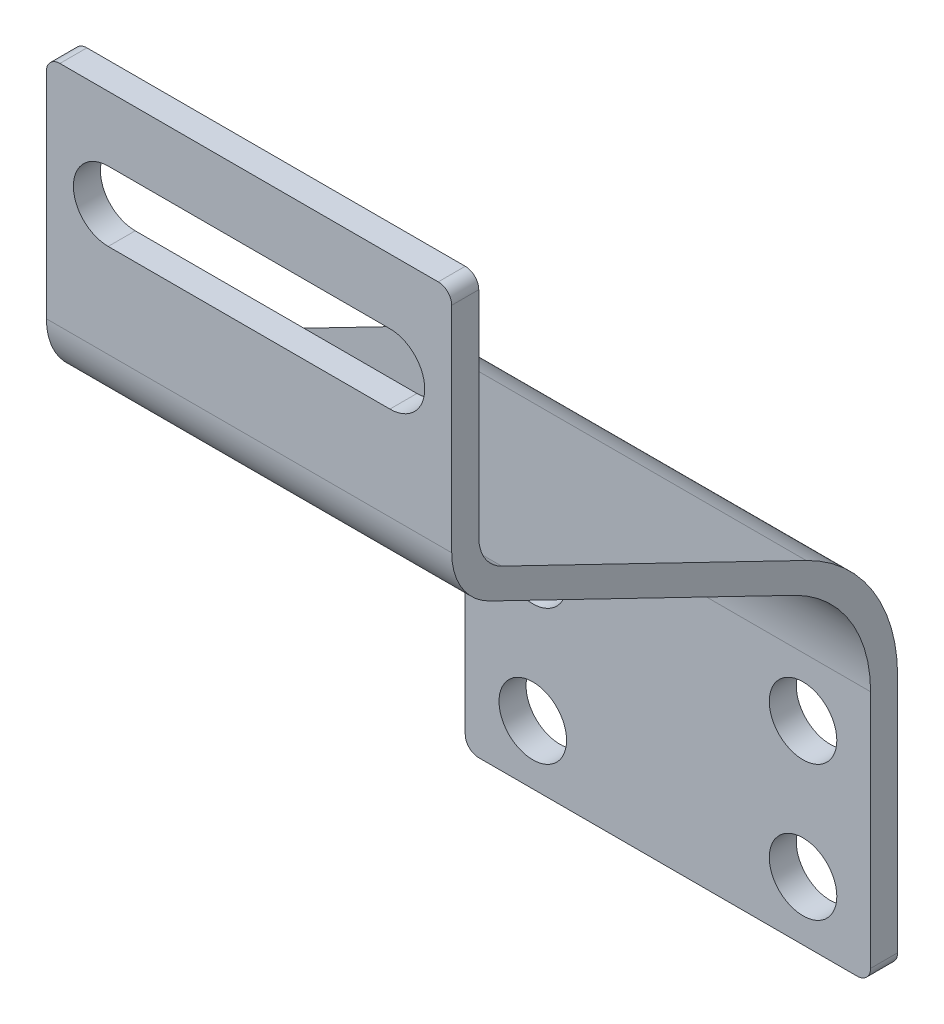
ISO-10303-21;
HEADER;
FILE_DESCRIPTION(('STEP AP214'),'2;1');
FILE_NAME('part.step','',(''),(''),'','','');
FILE_SCHEMA(('AUTOMOTIVE_DESIGN { 1 0 10303 214 1 1 1 1 }'));
ENDSEC;
DATA;
#1=APPLICATION_CONTEXT('core data for automotive mechanical design processes');
#2=APPLICATION_PROTOCOL_DEFINITION('international standard','automotive_design',2000,#1);
#3=PRODUCT_CONTEXT('',#1,'mechanical');
#4=PRODUCT('Part','Part','',(#3));
#5=PRODUCT_RELATED_PRODUCT_CATEGORY('part','',(#4));
#6=PRODUCT_DEFINITION_FORMATION('','',#4);
#7=PRODUCT_DEFINITION_CONTEXT('part definition',#1,'design');
#8=PRODUCT_DEFINITION('design','',#6,#7);
#9=PRODUCT_DEFINITION_SHAPE('','',#8);
#10=(LENGTH_UNIT() NAMED_UNIT(*) SI_UNIT(.MILLI.,.METRE.));
#11=(NAMED_UNIT(*) PLANE_ANGLE_UNIT() SI_UNIT($,.RADIAN.));
#12=(NAMED_UNIT(*) SI_UNIT($,.STERADIAN.) SOLID_ANGLE_UNIT());
#13=UNCERTAINTY_MEASURE_WITH_UNIT(LENGTH_MEASURE(1.E-05),#10,'distance_accuracy_value','');
#14=(GEOMETRIC_REPRESENTATION_CONTEXT(3) GLOBAL_UNCERTAINTY_ASSIGNED_CONTEXT((#13)) GLOBAL_UNIT_ASSIGNED_CONTEXT((#10,
#11,#12)) REPRESENTATION_CONTEXT('',''));
#15=CARTESIAN_POINT('',(0.,0.,0.));
#16=DIRECTION('',(0.,0.,1.));
#17=DIRECTION('',(1.,0.,0.));
#18=AXIS2_PLACEMENT_3D('',#15,#16,#17);
#19=CARTESIAN_POINT('',(30.,40.,-2.));
#20=DIRECTION('',(0.,1.,0.));
#21=DIRECTION('',(0.,0.,-1.));
#22=AXIS2_PLACEMENT_3D('',#19,#20,#21);
#23=PLANE('',#22);
#24=DIRECTION('',(-1.,0.,0.));
#25=VECTOR('',#24,1.);
#26=CARTESIAN_POINT('',(30.,40.,2.));
#27=LINE('',#26,#25);
#28=CARTESIAN_POINT('',(28.,40.,2.));
#29=VERTEX_POINT('',#28);
#30=CARTESIAN_POINT('',(-28.,40.,2.));
#31=VERTEX_POINT('',#30);
#32=EDGE_CURVE('E246',#29,#31,#27,.T.);
#33=ORIENTED_EDGE('',*,*,#32,.F.);
#34=DIRECTION('',(0.,0.,1.));
#35=VECTOR('',#34,1.);
#36=CARTESIAN_POINT('',(28.,40.,2.));
#37=LINE('',#36,#35);
#38=CARTESIAN_POINT('',(28.,40.,-2.));
#39=VERTEX_POINT('',#38);
#40=EDGE_CURVE('E356',#39,#29,#37,.T.);
#41=ORIENTED_EDGE('',*,*,#40,.F.);
#42=DIRECTION('',(-1.,0.,0.));
#43=VECTOR('',#42,1.);
#44=CARTESIAN_POINT('',(30.,40.,-2.));
#45=LINE('',#44,#43);
#46=CARTESIAN_POINT('',(-28.,40.,-2.));
#47=VERTEX_POINT('',#46);
#48=EDGE_CURVE('E273',#39,#47,#45,.T.);
#49=ORIENTED_EDGE('',*,*,#48,.T.);
#50=DIRECTION('',(0.,0.,1.));
#51=VECTOR('',#50,1.);
#52=CARTESIAN_POINT('',(-28.,40.,-2.));
#53=LINE('',#52,#51);
#54=EDGE_CURVE('E358',#31,#47,#53,.F.);
#55=ORIENTED_EDGE('',*,*,#54,.F.);
#56=EDGE_LOOP('',(#33,#41,#49,#55));
#57=FACE_BOUND('',#56,.T.);
#58=ADVANCED_FACE('F37',(#57),#23,.T.);
#59=CARTESIAN_POINT('',(30.,40.,-2.));
#60=DIRECTION('',(0.,0.,1.));
#61=DIRECTION('',(0.,1.,0.));
#62=AXIS2_PLACEMENT_3D('',#59,#60,#61);
#63=PLANE('',#62);
#64=DIRECTION('',(1.,0.,0.));
#65=VECTOR('',#64,1.);
#66=CARTESIAN_POINT('',(-20.85,20.119247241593,-2.));
#67=LINE('',#66,#65);
#68=CARTESIAN_POINT('',(-20.85,20.119247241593,-2.));
#69=VERTEX_POINT('',#68);
#70=CARTESIAN_POINT('',(20.85,20.119247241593,-2.));
#71=VERTEX_POINT('',#70);
#72=EDGE_CURVE('E177',#69,#71,#67,.T.);
#73=ORIENTED_EDGE('',*,*,#72,.T.);
#74=CARTESIAN_POINT('',(20.85,25.269247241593,-2.));
#75=DIRECTION('',(0.,0.,1.));
#76=DIRECTION('',(1.,0.,0.));
#77=AXIS2_PLACEMENT_3D('',#74,#75,#76);
#78=CIRCLE('',#77,5.15000000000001);
#79=CARTESIAN_POINT('',(20.85,30.419247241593,-2.));
#80=VERTEX_POINT('',#79);
#81=EDGE_CURVE('E187',#71,#80,#78,.T.);
#82=ORIENTED_EDGE('',*,*,#81,.T.);
#83=DIRECTION('',(-1.,0.,0.));
#84=VECTOR('',#83,1.);
#85=CARTESIAN_POINT('',(-20.85,30.419247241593,-2.));
#86=LINE('',#85,#84);
#87=CARTESIAN_POINT('',(-20.85,30.419247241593,-2.));
#88=VERTEX_POINT('',#87);
#89=EDGE_CURVE('E192',#80,#88,#86,.T.);
#90=ORIENTED_EDGE('',*,*,#89,.T.);
#91=CARTESIAN_POINT('',(-20.85,25.269247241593,-2.));
#92=DIRECTION('',(0.,0.,1.));
#93=DIRECTION('',(1.,0.,0.));
#94=AXIS2_PLACEMENT_3D('',#91,#92,#93);
#95=CIRCLE('',#94,5.15000000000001);
#96=EDGE_CURVE('E197',#88,#69,#95,.T.);
#97=ORIENTED_EDGE('',*,*,#96,.T.);
#98=EDGE_LOOP('',(#73,#82,#90,#97));
#99=FACE_BOUND('',#98,.T.);
#100=ORIENTED_EDGE('',*,*,#48,.F.);
#101=CARTESIAN_POINT('',(28.,38.,-2.));
#102=DIRECTION('',(0.,0.,-1.));
#103=DIRECTION('',(0.,1.,0.));
#104=AXIS2_PLACEMENT_3D('',#101,#102,#103);
#105=CIRCLE('',#104,2.);
#106=CARTESIAN_POINT('',(30.,38.,-2.));
#107=VERTEX_POINT('',#106);
#108=EDGE_CURVE('E45',#107,#39,#105,.F.);
#109=ORIENTED_EDGE('',*,*,#108,.F.);
#110=DIRECTION('',(0.,-1.,0.));
#111=VECTOR('',#110,1.);
#112=CARTESIAN_POINT('',(30.,40.,-2.));
#113=LINE('',#112,#111);
#114=CARTESIAN_POINT('',(30.,6.27043571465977,-2.));
#115=VERTEX_POINT('',#114);
#116=EDGE_CURVE('E243',#107,#115,#113,.T.);
#117=ORIENTED_EDGE('',*,*,#116,.T.);
#118=DIRECTION('',(-1.,0.,0.));
#119=VECTOR('',#118,1.);
#120=CARTESIAN_POINT('',(30.,6.27043571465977,-2.));
#121=LINE('',#120,#119);
#122=CARTESIAN_POINT('',(-30.,6.27043571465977,-2.));
#123=VERTEX_POINT('',#122);
#124=EDGE_CURVE('E276',#115,#123,#121,.T.);
#125=ORIENTED_EDGE('',*,*,#124,.T.);
#126=DIRECTION('',(0.,-1.,0.));
#127=VECTOR('',#126,1.);
#128=CARTESIAN_POINT('',(-30.,40.,-2.));
#129=LINE('',#128,#127);
#130=CARTESIAN_POINT('',(-30.,38.,-2.));
#131=VERTEX_POINT('',#130);
#132=EDGE_CURVE('E222',#131,#123,#129,.T.);
#133=ORIENTED_EDGE('',*,*,#132,.F.);
#134=CARTESIAN_POINT('',(-28.,38.,-2.));
#135=DIRECTION('',(0.,0.,-1.));
#136=DIRECTION('',(0.,1.,0.));
#137=AXIS2_PLACEMENT_3D('',#134,#135,#136);
#138=CIRCLE('',#137,2.);
#139=EDGE_CURVE('E11',#47,#131,#138,.F.);
#140=ORIENTED_EDGE('',*,*,#139,.F.);
#141=EDGE_LOOP('',(#100,#109,#117,#125,#133,#140));
#142=FACE_BOUND('',#141,.T.);
#143=ADVANCED_FACE('F195',(#99,#142),#63,.F.);
#144=CARTESIAN_POINT('',(30.,6.27043571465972,-8.));
#145=DIRECTION('',(-1.,0.,0.));
#146=DIRECTION('',(0.,0.,-1.));
#147=AXIS2_PLACEMENT_3D('',#144,#145,#146);
#148=CYLINDRICAL_SURFACE('',#147,6.);
#149=CARTESIAN_POINT('',(-30.,6.27043571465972,-8.));
#150=DIRECTION('',(1.,0.,0.));
#151=DIRECTION('',(0.,0.,-1.));
#152=AXIS2_PLACEMENT_3D('',#149,#150,#151);
#153=CIRCLE('',#152,6.);
#154=CARTESIAN_POINT('',(-30.,0.869480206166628,-5.38663443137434));
#155=VERTEX_POINT('',#154);
#156=EDGE_CURVE('E268',#123,#155,#153,.T.);
#157=ORIENTED_EDGE('',*,*,#156,.F.);
#158=ORIENTED_EDGE('',*,*,#124,.F.);
#159=CARTESIAN_POINT('',(30.,6.27043571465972,-8.));
#160=DIRECTION('',(1.,0.,0.));
#161=DIRECTION('',(0.,0.,-1.));
#162=AXIS2_PLACEMENT_3D('',#159,#160,#161);
#163=CIRCLE('',#162,6.);
#164=CARTESIAN_POINT('',(30.,0.869480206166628,-5.38663443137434));
#165=VERTEX_POINT('',#164);
#166=EDGE_CURVE('E240',#115,#165,#163,.T.);
#167=ORIENTED_EDGE('',*,*,#166,.T.);
#168=DIRECTION('',(-1.,0.,0.));
#169=VECTOR('',#168,1.);
#170=CARTESIAN_POINT('',(30.,0.869480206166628,-5.38663443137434));
#171=LINE('',#170,#169);
#172=EDGE_CURVE('E279',#165,#155,#171,.T.);
#173=ORIENTED_EDGE('',*,*,#172,.T.);
#174=EDGE_LOOP('',(#157,#158,#167,#173));
#175=FACE_BOUND('',#174,.T.);
#176=ADVANCED_FACE('F372',(#175),#148,.F.);
#177=CARTESIAN_POINT('',(30.,0.869480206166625,-5.38663443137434));
#178=DIRECTION('',(0.,-0.900159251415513,0.435560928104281));
#179=DIRECTION('',(0.,0.435560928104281,0.900159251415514));
#180=AXIS2_PLACEMENT_3D('',#177,#178,#179);
#181=PLANE('',#180);
#182=DIRECTION('',(0.,-0.435560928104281,-0.900159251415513));
#183=VECTOR('',#182,1.);
#184=CARTESIAN_POINT('',(-30.,0.869480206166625,-5.38663443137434));
#185=LINE('',#184,#183);
#186=CARTESIAN_POINT('',(-30.,-20.9370493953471,-50.4534622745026));
#187=VERTEX_POINT('',#186);
#188=EDGE_CURVE('E265',#155,#187,#185,.T.);
#189=ORIENTED_EDGE('',*,*,#188,.F.);
#190=ORIENTED_EDGE('',*,*,#172,.F.);
#191=DIRECTION('',(0.,-0.435560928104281,-0.900159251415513));
#192=VECTOR('',#191,1.);
#193=CARTESIAN_POINT('',(30.,0.869480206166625,-5.38663443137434));
#194=LINE('',#193,#192);
#195=CARTESIAN_POINT('',(30.,-20.9370493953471,-50.4534622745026));
#196=VERTEX_POINT('',#195);
#197=EDGE_CURVE('E237',#165,#196,#194,.T.);
#198=ORIENTED_EDGE('',*,*,#197,.T.);
#199=DIRECTION('',(-1.,0.,0.));
#200=VECTOR('',#199,1.);
#201=CARTESIAN_POINT('',(30.,-20.9370493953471,-50.4534622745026));
#202=LINE('',#201,#200);
#203=EDGE_CURVE('E282',#196,#187,#202,.T.);
#204=ORIENTED_EDGE('',*,*,#203,.T.);
#205=EDGE_LOOP('',(#189,#190,#198,#204));
#206=FACE_BOUND('',#205,.T.);
#207=ADVANCED_FACE('F429',(#206),#181,.F.);
#208=CARTESIAN_POINT('',(30.,-42.5408714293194,-40.));
#209=DIRECTION('',(-1.,0.,0.));
#210=DIRECTION('',(0.,0.,-1.));
#211=AXIS2_PLACEMENT_3D('',#208,#209,#210);
#212=CYLINDRICAL_SURFACE('',#211,24.);
#213=CARTESIAN_POINT('',(-30.,-42.5408714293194,-40.));
#214=DIRECTION('',(-1.,0.,0.));
#215=DIRECTION('',(0.,0.,1.));
#216=AXIS2_PLACEMENT_3D('',#213,#214,#215);
#217=CIRCLE('',#216,24.);
#218=CARTESIAN_POINT('',(-30.,-42.5408714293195,-64.));
#219=VERTEX_POINT('',#218);
#220=EDGE_CURVE('E262',#187,#219,#217,.T.);
#221=ORIENTED_EDGE('',*,*,#220,.F.);
#222=ORIENTED_EDGE('',*,*,#203,.F.);
#223=CARTESIAN_POINT('',(30.,-42.5408714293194,-40.));
#224=DIRECTION('',(-1.,0.,0.));
#225=DIRECTION('',(0.,0.,1.));
#226=AXIS2_PLACEMENT_3D('',#223,#224,#225);
#227=CIRCLE('',#226,24.);
#228=CARTESIAN_POINT('',(30.,-42.5408714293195,-64.));
#229=VERTEX_POINT('',#228);
#230=EDGE_CURVE('E234',#196,#229,#227,.T.);
#231=ORIENTED_EDGE('',*,*,#230,.T.);
#232=DIRECTION('',(-1.,0.,0.));
#233=VECTOR('',#232,1.);
#234=CARTESIAN_POINT('',(30.,-42.5408714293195,-64.));
#235=LINE('',#234,#233);
#236=EDGE_CURVE('E285',#229,#219,#235,.T.);
#237=ORIENTED_EDGE('',*,*,#236,.T.);
#238=EDGE_LOOP('',(#221,#222,#231,#237));
#239=FACE_BOUND('',#238,.T.);
#240=ADVANCED_FACE('F427',(#239),#212,.T.);
#241=CARTESIAN_POINT('',(30.,-42.5408714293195,-64.));
#242=DIRECTION('',(0.,0.,1.));
#243=DIRECTION('',(-1.,0.,0.));
#244=AXIS2_PLACEMENT_3D('',#241,#242,#243);
#245=PLANE('',#244);
#246=CARTESIAN_POINT('',(-20.,-71.2704357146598,-64.));
#247=DIRECTION('',(0.,0.,1.));
#248=DIRECTION('',(1.,0.,0.));
#249=AXIS2_PLACEMENT_3D('',#246,#247,#248);
#250=CIRCLE('',#249,5.);
#251=CARTESIAN_POINT('',(-15.,-71.2704357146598,-64.));
#252=VERTEX_POINT('',#251);
#253=EDGE_CURVE('E204',#252,#252,#250,.T.);
#254=ORIENTED_EDGE('',*,*,#253,.T.);
#255=EDGE_LOOP('',(#254));
#256=FACE_BOUND('',#255,.T.);
#257=CARTESIAN_POINT('',(20.,-71.2704357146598,-64.));
#258=DIRECTION('',(0.,0.,1.));
#259=DIRECTION('',(1.,0.,0.));
#260=AXIS2_PLACEMENT_3D('',#257,#258,#259);
#261=CIRCLE('',#260,5.);
#262=CARTESIAN_POINT('',(25.,-71.2704357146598,-64.));
#263=VERTEX_POINT('',#262);
#264=EDGE_CURVE('E211',#263,#263,#261,.T.);
#265=ORIENTED_EDGE('',*,*,#264,.T.);
#266=EDGE_LOOP('',(#265));
#267=FACE_BOUND('',#266,.T.);
#268=CARTESIAN_POINT('',(20.,-51.2704357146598,-64.));
#269=DIRECTION('',(0.,0.,1.));
#270=DIRECTION('',(1.,0.,0.));
#271=AXIS2_PLACEMENT_3D('',#268,#269,#270);
#272=CIRCLE('',#271,5.);
#273=CARTESIAN_POINT('',(25.,-51.2704357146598,-64.));
#274=VERTEX_POINT('',#273);
#275=EDGE_CURVE('E207',#274,#274,#272,.T.);
#276=ORIENTED_EDGE('',*,*,#275,.T.);
#277=EDGE_LOOP('',(#276));
#278=FACE_BOUND('',#277,.T.);
#279=CARTESIAN_POINT('',(-20.,-51.2704357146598,-64.));
#280=DIRECTION('',(0.,0.,1.));
#281=DIRECTION('',(1.,0.,0.));
#282=AXIS2_PLACEMENT_3D('',#279,#280,#281);
#283=CIRCLE('',#282,5.);
#284=CARTESIAN_POINT('',(-15.,-51.2704357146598,-64.));
#285=VERTEX_POINT('',#284);
#286=EDGE_CURVE('E210',#285,#285,#283,.T.);
#287=ORIENTED_EDGE('',*,*,#286,.T.);
#288=EDGE_LOOP('',(#287));
#289=FACE_BOUND('',#288,.T.);
#290=DIRECTION('',(0.,-1.,0.));
#291=VECTOR('',#290,1.);
#292=CARTESIAN_POINT('',(-30.,-42.5408714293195,-64.));
#293=LINE('',#292,#291);
#294=CARTESIAN_POINT('',(-30.,-78.,-64.));
#295=VERTEX_POINT('',#294);
#296=EDGE_CURVE('E259',#219,#295,#293,.T.);
#297=ORIENTED_EDGE('',*,*,#296,.F.);
#298=ORIENTED_EDGE('',*,*,#236,.F.);
#299=DIRECTION('',(0.,-1.,0.));
#300=VECTOR('',#299,1.);
#301=CARTESIAN_POINT('',(30.,-42.5408714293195,-64.));
#302=LINE('',#301,#300);
#303=CARTESIAN_POINT('',(30.,-78.,-64.));
#304=VERTEX_POINT('',#303);
#305=EDGE_CURVE('E231',#229,#304,#302,.T.);
#306=ORIENTED_EDGE('',*,*,#305,.T.);
#307=CARTESIAN_POINT('',(28.,-78.,-64.));
#308=DIRECTION('',(0.,0.,-1.));
#309=DIRECTION('',(-1.,0.,0.));
#310=AXIS2_PLACEMENT_3D('',#307,#308,#309);
#311=CIRCLE('',#310,2.);
#312=CARTESIAN_POINT('',(28.,-80.,-64.));
#313=VERTEX_POINT('',#312);
#314=EDGE_CURVE('E331',#313,#304,#311,.F.);
#315=ORIENTED_EDGE('',*,*,#314,.F.);
#316=DIRECTION('',(-1.,0.,0.));
#317=VECTOR('',#316,1.);
#318=CARTESIAN_POINT('',(30.,-80.,-64.));
#319=LINE('',#318,#317);
#320=CARTESIAN_POINT('',(-28.,-80.,-64.));
#321=VERTEX_POINT('',#320);
#322=EDGE_CURVE('E288',#313,#321,#319,.T.);
#323=ORIENTED_EDGE('',*,*,#322,.T.);
#324=CARTESIAN_POINT('',(-28.,-78.,-64.));
#325=DIRECTION('',(0.,0.,-1.));
#326=DIRECTION('',(-1.,0.,0.));
#327=AXIS2_PLACEMENT_3D('',#324,#325,#326);
#328=CIRCLE('',#327,2.);
#329=EDGE_CURVE('E334',#295,#321,#328,.F.);
#330=ORIENTED_EDGE('',*,*,#329,.F.);
#331=EDGE_LOOP('',(#297,#298,#306,#315,#323,#330));
#332=FACE_BOUND('',#331,.T.);
#333=ADVANCED_FACE('F416',(#256,#267,#278,#289,#332),#245,.F.);
#334=CARTESIAN_POINT('',(30.,-80.,-60.));
#335=DIRECTION('',(0.,-1.,0.));
#336=DIRECTION('',(0.,0.,1.));
#337=AXIS2_PLACEMENT_3D('',#334,#335,#336);
#338=PLANE('',#337);
#339=ORIENTED_EDGE('',*,*,#322,.F.);
#340=DIRECTION('',(0.,0.,-1.));
#341=VECTOR('',#340,1.);
#342=CARTESIAN_POINT('',(28.,-80.,-64.));
#343=LINE('',#342,#341);
#344=CARTESIAN_POINT('',(28.,-80.,-60.));
#345=VERTEX_POINT('',#344);
#346=EDGE_CURVE('E337',#345,#313,#343,.T.);
#347=ORIENTED_EDGE('',*,*,#346,.F.);
#348=DIRECTION('',(-1.,0.,0.));
#349=VECTOR('',#348,1.);
#350=CARTESIAN_POINT('',(30.,-80.,-60.));
#351=LINE('',#350,#349);
#352=CARTESIAN_POINT('',(-28.,-80.,-60.));
#353=VERTEX_POINT('',#352);
#354=EDGE_CURVE('E291',#345,#353,#351,.T.);
#355=ORIENTED_EDGE('',*,*,#354,.T.);
#356=DIRECTION('',(0.,0.,-1.));
#357=VECTOR('',#356,1.);
#358=CARTESIAN_POINT('',(-28.,-80.,-60.));
#359=LINE('',#358,#357);
#360=EDGE_CURVE('E339',#321,#353,#359,.F.);
#361=ORIENTED_EDGE('',*,*,#360,.F.);
#362=EDGE_LOOP('',(#339,#347,#355,#361));
#363=FACE_BOUND('',#362,.T.);
#364=ADVANCED_FACE('F412',(#363),#338,.T.);
#365=CARTESIAN_POINT('',(30.,-42.5408714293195,-60.));
#366=DIRECTION('',(0.,0.,1.));
#367=DIRECTION('',(0.,1.,0.));
#368=AXIS2_PLACEMENT_3D('',#365,#366,#367);
#369=PLANE('',#368);
#370=CARTESIAN_POINT('',(-20.,-71.2704357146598,-60.));
#371=DIRECTION('',(0.,0.,-1.));
#372=DIRECTION('',(0.,1.,0.));
#373=AXIS2_PLACEMENT_3D('',#370,#371,#372);
#374=CIRCLE('',#373,5.);
#375=CARTESIAN_POINT('',(-20.,-66.2704357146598,-60.));
#376=VERTEX_POINT('',#375);
#377=EDGE_CURVE('E250',#376,#376,#374,.T.);
#378=ORIENTED_EDGE('',*,*,#377,.T.);
#379=EDGE_LOOP('',(#378));
#380=FACE_BOUND('',#379,.T.);
#381=CARTESIAN_POINT('',(20.,-71.2704357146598,-60.));
#382=DIRECTION('',(0.,0.,-1.));
#383=DIRECTION('',(0.,1.,0.));
#384=AXIS2_PLACEMENT_3D('',#381,#382,#383);
#385=CIRCLE('',#384,5.);
#386=CARTESIAN_POINT('',(20.,-66.2704357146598,-60.));
#387=VERTEX_POINT('',#386);
#388=EDGE_CURVE('E313',#387,#387,#385,.T.);
#389=ORIENTED_EDGE('',*,*,#388,.T.);
#390=EDGE_LOOP('',(#389));
#391=FACE_BOUND('',#390,.T.);
#392=CARTESIAN_POINT('',(20.,-51.2704357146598,-60.));
#393=DIRECTION('',(0.,0.,-1.));
#394=DIRECTION('',(0.,1.,0.));
#395=AXIS2_PLACEMENT_3D('',#392,#393,#394);
#396=CIRCLE('',#395,5.);
#397=CARTESIAN_POINT('',(20.,-46.2704357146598,-60.));
#398=VERTEX_POINT('',#397);
#399=EDGE_CURVE('E310',#398,#398,#396,.T.);
#400=ORIENTED_EDGE('',*,*,#399,.T.);
#401=EDGE_LOOP('',(#400));
#402=FACE_BOUND('',#401,.T.);
#403=CARTESIAN_POINT('',(-20.,-51.2704357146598,-60.));
#404=DIRECTION('',(0.,0.,-1.));
#405=DIRECTION('',(0.,1.,0.));
#406=AXIS2_PLACEMENT_3D('',#403,#404,#405);
#407=CIRCLE('',#406,5.);
#408=CARTESIAN_POINT('',(-20.,-46.2704357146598,-60.));
#409=VERTEX_POINT('',#408);
#410=EDGE_CURVE('E218',#409,#409,#407,.T.);
#411=ORIENTED_EDGE('',*,*,#410,.T.);
#412=EDGE_LOOP('',(#411));
#413=FACE_BOUND('',#412,.T.);
#414=ORIENTED_EDGE('',*,*,#354,.F.);
#415=CARTESIAN_POINT('',(28.,-78.,-60.));
#416=DIRECTION('',(0.,0.,-1.));
#417=DIRECTION('',(0.,1.,0.));
#418=AXIS2_PLACEMENT_3D('',#415,#416,#417);
#419=CIRCLE('',#418,2.);
#420=CARTESIAN_POINT('',(30.,-78.,-60.));
#421=VERTEX_POINT('',#420);
#422=EDGE_CURVE('E342',#421,#345,#419,.T.);
#423=ORIENTED_EDGE('',*,*,#422,.F.);
#424=DIRECTION('',(0.,-1.,0.));
#425=VECTOR('',#424,1.);
#426=CARTESIAN_POINT('',(30.,-42.5408714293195,-60.));
#427=LINE('',#426,#425);
#428=CARTESIAN_POINT('',(30.,-42.5408714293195,-60.));
#429=VERTEX_POINT('',#428);
#430=EDGE_CURVE('E228',#429,#421,#427,.T.);
#431=ORIENTED_EDGE('',*,*,#430,.F.);
#432=DIRECTION('',(-1.,0.,0.));
#433=VECTOR('',#432,1.);
#434=CARTESIAN_POINT('',(30.,-42.5408714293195,-60.));
#435=LINE('',#434,#433);
#436=CARTESIAN_POINT('',(-30.,-42.5408714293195,-60.));
#437=VERTEX_POINT('',#436);
#438=EDGE_CURVE('E294',#429,#437,#435,.T.);
#439=ORIENTED_EDGE('',*,*,#438,.T.);
#440=DIRECTION('',(0.,-1.,0.));
#441=VECTOR('',#440,1.);
#442=CARTESIAN_POINT('',(-30.,-42.5408714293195,-60.));
#443=LINE('',#442,#441);
#444=CARTESIAN_POINT('',(-30.,-78.,-60.));
#445=VERTEX_POINT('',#444);
#446=EDGE_CURVE('E256',#437,#445,#443,.T.);
#447=ORIENTED_EDGE('',*,*,#446,.T.);
#448=CARTESIAN_POINT('',(-28.,-78.,-60.));
#449=DIRECTION('',(0.,0.,-1.));
#450=DIRECTION('',(0.,1.,0.));
#451=AXIS2_PLACEMENT_3D('',#448,#449,#450);
#452=CIRCLE('',#451,2.);
#453=EDGE_CURVE('E344',#353,#445,#452,.T.);
#454=ORIENTED_EDGE('',*,*,#453,.F.);
#455=EDGE_LOOP('',(#414,#423,#431,#439,#447,#454));
#456=FACE_BOUND('',#455,.T.);
#457=ADVANCED_FACE('F410',(#380,#391,#402,#413,#456),#369,.T.);
#458=CARTESIAN_POINT('',(30.,-42.5408714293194,-40.));
#459=DIRECTION('',(-1.,0.,0.));
#460=DIRECTION('',(0.,0.,-1.));
#461=AXIS2_PLACEMENT_3D('',#458,#459,#460);
#462=CYLINDRICAL_SURFACE('',#461,20.);
#463=CARTESIAN_POINT('',(-30.,-42.5408714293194,-40.));
#464=DIRECTION('',(-1.,0.,0.));
#465=DIRECTION('',(0.,0.,1.));
#466=AXIS2_PLACEMENT_3D('',#463,#464,#465);
#467=CIRCLE('',#466,20.);
#468=CARTESIAN_POINT('',(-30.,-24.5376864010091,-48.7112185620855));
#469=VERTEX_POINT('',#468);
#470=EDGE_CURVE('E254',#469,#437,#467,.T.);
#471=ORIENTED_EDGE('',*,*,#470,.T.);
#472=ORIENTED_EDGE('',*,*,#438,.F.);
#473=CARTESIAN_POINT('',(30.,-42.5408714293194,-40.));
#474=DIRECTION('',(-1.,0.,0.));
#475=DIRECTION('',(0.,0.,1.));
#476=AXIS2_PLACEMENT_3D('',#473,#474,#475);
#477=CIRCLE('',#476,20.);
#478=CARTESIAN_POINT('',(30.,-24.5376864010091,-48.7112185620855));
#479=VERTEX_POINT('',#478);
#480=EDGE_CURVE('E226',#479,#429,#477,.T.);
#481=ORIENTED_EDGE('',*,*,#480,.F.);
#482=DIRECTION('',(-1.,0.,0.));
#483=VECTOR('',#482,1.);
#484=CARTESIAN_POINT('',(30.,-24.5376864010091,-48.7112185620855));
#485=LINE('',#484,#483);
#486=EDGE_CURVE('E297',#479,#469,#485,.T.);
#487=ORIENTED_EDGE('',*,*,#486,.T.);
#488=EDGE_LOOP('',(#471,#472,#481,#487));
#489=FACE_BOUND('',#488,.T.);
#490=ADVANCED_FACE('F422',(#489),#462,.F.);
#491=CARTESIAN_POINT('',(30.,-2.73115679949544,-3.64439071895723));
#492=DIRECTION('',(0.,-0.900159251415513,0.435560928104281));
#493=DIRECTION('',(0.,0.435560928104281,0.900159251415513));
#494=AXIS2_PLACEMENT_3D('',#491,#492,#493);
#495=PLANE('',#494);
#496=DIRECTION('',(0.,-0.435560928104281,-0.900159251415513));
#497=VECTOR('',#496,1.);
#498=CARTESIAN_POINT('',(-30.,-2.73115679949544,-3.64439071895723));
#499=LINE('',#498,#497);
#500=CARTESIAN_POINT('',(-30.,-2.73115679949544,-3.64439071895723));
#501=VERTEX_POINT('',#500);
#502=EDGE_CURVE('E252',#501,#469,#499,.T.);
#503=ORIENTED_EDGE('',*,*,#502,.T.);
#504=ORIENTED_EDGE('',*,*,#486,.F.);
#505=DIRECTION('',(0.,-0.435560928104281,-0.900159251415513));
#506=VECTOR('',#505,1.);
#507=CARTESIAN_POINT('',(30.,-2.73115679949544,-3.64439071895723));
#508=LINE('',#507,#506);
#509=CARTESIAN_POINT('',(30.,-2.73115679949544,-3.64439071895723));
#510=VERTEX_POINT('',#509);
#511=EDGE_CURVE('E224',#510,#479,#508,.T.);
#512=ORIENTED_EDGE('',*,*,#511,.F.);
#513=DIRECTION('',(-1.,0.,0.));
#514=VECTOR('',#513,1.);
#515=CARTESIAN_POINT('',(30.,-2.73115679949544,-3.64439071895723));
#516=LINE('',#515,#514);
#517=EDGE_CURVE('E300',#510,#501,#516,.T.);
#518=ORIENTED_EDGE('',*,*,#517,.T.);
#519=EDGE_LOOP('',(#503,#504,#512,#518));
#520=FACE_BOUND('',#519,.T.);
#521=ADVANCED_FACE('F449',(#520),#495,.T.);
#522=CARTESIAN_POINT('',(30.,6.27043571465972,-8.));
#523=DIRECTION('',(-1.,0.,0.));
#524=DIRECTION('',(0.,0.,-1.));
#525=AXIS2_PLACEMENT_3D('',#522,#523,#524);
#526=CYLINDRICAL_SURFACE('',#525,10.);
#527=CARTESIAN_POINT('',(-30.,6.27043571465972,-8.));
#528=DIRECTION('',(1.,0.,0.));
#529=DIRECTION('',(0.,0.,-1.));
#530=AXIS2_PLACEMENT_3D('',#527,#528,#529);
#531=CIRCLE('',#530,10.);
#532=CARTESIAN_POINT('',(-30.,6.27043571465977,2.));
#533=VERTEX_POINT('',#532);
#534=EDGE_CURVE('E249',#533,#501,#531,.T.);
#535=ORIENTED_EDGE('',*,*,#534,.T.);
#536=ORIENTED_EDGE('',*,*,#517,.F.);
#537=CARTESIAN_POINT('',(30.,6.27043571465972,-8.));
#538=DIRECTION('',(1.,0.,0.));
#539=DIRECTION('',(0.,0.,-1.));
#540=AXIS2_PLACEMENT_3D('',#537,#538,#539);
#541=CIRCLE('',#540,10.);
#542=CARTESIAN_POINT('',(30.,6.27043571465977,2.));
#543=VERTEX_POINT('',#542);
#544=EDGE_CURVE('E221',#543,#510,#541,.T.);
#545=ORIENTED_EDGE('',*,*,#544,.F.);
#546=DIRECTION('',(-1.,0.,0.));
#547=VECTOR('',#546,1.);
#548=CARTESIAN_POINT('',(30.,6.27043571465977,2.));
#549=LINE('',#548,#547);
#550=EDGE_CURVE('E303',#543,#533,#549,.T.);
#551=ORIENTED_EDGE('',*,*,#550,.T.);
#552=EDGE_LOOP('',(#535,#536,#545,#551));
#553=FACE_BOUND('',#552,.T.);
#554=ADVANCED_FACE('F451',(#553),#526,.T.);
#555=CARTESIAN_POINT('',(30.,40.,2.));
#556=DIRECTION('',(0.,0.,1.));
#557=DIRECTION('',(0.,1.,0.));
#558=AXIS2_PLACEMENT_3D('',#555,#556,#557);
#559=PLANE('',#558);
#560=CARTESIAN_POINT('',(-20.85,25.269247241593,2.));
#561=DIRECTION('',(0.,0.,-1.));
#562=DIRECTION('',(0.,1.,0.));
#563=AXIS2_PLACEMENT_3D('',#560,#561,#562);
#564=CIRCLE('',#563,5.15000000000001);
#565=CARTESIAN_POINT('',(-20.85,20.119247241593,2.));
#566=VERTEX_POINT('',#565);
#567=CARTESIAN_POINT('',(-20.85,30.419247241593,2.));
#568=VERTEX_POINT('',#567);
#569=EDGE_CURVE('E324',#566,#568,#564,.T.);
#570=ORIENTED_EDGE('',*,*,#569,.T.);
#571=DIRECTION('',(1.,0.,0.));
#572=VECTOR('',#571,1.);
#573=CARTESIAN_POINT('',(30.,30.419247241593,2.));
#574=LINE('',#573,#572);
#575=CARTESIAN_POINT('',(20.85,30.419247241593,2.));
#576=VERTEX_POINT('',#575);
#577=EDGE_CURVE('E321',#568,#576,#574,.T.);
#578=ORIENTED_EDGE('',*,*,#577,.T.);
#579=CARTESIAN_POINT('',(20.85,25.269247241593,2.));
#580=DIRECTION('',(0.,0.,-1.));
#581=DIRECTION('',(0.,1.,0.));
#582=AXIS2_PLACEMENT_3D('',#579,#580,#581);
#583=CIRCLE('',#582,5.15000000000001);
#584=CARTESIAN_POINT('',(20.85,20.119247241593,2.));
#585=VERTEX_POINT('',#584);
#586=EDGE_CURVE('E319',#576,#585,#583,.T.);
#587=ORIENTED_EDGE('',*,*,#586,.T.);
#588=DIRECTION('',(-1.,0.,0.));
#589=VECTOR('',#588,1.);
#590=CARTESIAN_POINT('',(30.,20.119247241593,2.));
#591=LINE('',#590,#589);
#592=EDGE_CURVE('E179',#585,#566,#591,.T.);
#593=ORIENTED_EDGE('',*,*,#592,.T.);
#594=EDGE_LOOP('',(#570,#578,#587,#593));
#595=FACE_BOUND('',#594,.T.);
#596=DIRECTION('',(0.,-1.,0.));
#597=VECTOR('',#596,1.);
#598=CARTESIAN_POINT('',(-30.,40.,2.));
#599=LINE('',#598,#597);
#600=CARTESIAN_POINT('',(-30.,38.,2.));
#601=VERTEX_POINT('',#600);
#602=EDGE_CURVE('E247',#601,#533,#599,.T.);
#603=ORIENTED_EDGE('',*,*,#602,.T.);
#604=ORIENTED_EDGE('',*,*,#550,.F.);
#605=DIRECTION('',(0.,-1.,0.));
#606=VECTOR('',#605,1.);
#607=CARTESIAN_POINT('',(30.,40.,2.));
#608=LINE('',#607,#606);
#609=CARTESIAN_POINT('',(30.,38.,2.));
#610=VERTEX_POINT('',#609);
#611=EDGE_CURVE('E219',#610,#543,#608,.T.);
#612=ORIENTED_EDGE('',*,*,#611,.F.);
#613=CARTESIAN_POINT('',(28.,38.,2.));
#614=DIRECTION('',(0.,0.,-1.));
#615=DIRECTION('',(0.,1.,0.));
#616=AXIS2_PLACEMENT_3D('',#613,#614,#615);
#617=CIRCLE('',#616,2.);
#618=EDGE_CURVE('E351',#29,#610,#617,.T.);
#619=ORIENTED_EDGE('',*,*,#618,.F.);
#620=ORIENTED_EDGE('',*,*,#32,.T.);
#621=CARTESIAN_POINT('',(-28.,38.,2.));
#622=DIRECTION('',(0.,0.,-1.));
#623=DIRECTION('',(0.,1.,0.));
#624=AXIS2_PLACEMENT_3D('',#621,#622,#623);
#625=CIRCLE('',#624,2.);
#626=EDGE_CURVE('E354',#601,#31,#625,.T.);
#627=ORIENTED_EDGE('',*,*,#626,.F.);
#628=EDGE_LOOP('',(#603,#604,#612,#619,#620,#627));
#629=FACE_BOUND('',#628,.T.);
#630=ADVANCED_FACE('F379',(#595,#629),#559,.T.);
#631=CARTESIAN_POINT('',(30.,6.27043571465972,-8.));
#632=DIRECTION('',(-1.,0.,0.));
#633=DIRECTION('',(0.,0.,-1.));
#634=AXIS2_PLACEMENT_3D('',#631,#632,#633);
#635=PLANE('',#634);
#636=ORIENTED_EDGE('',*,*,#305,.F.);
#637=ORIENTED_EDGE('',*,*,#230,.F.);
#638=ORIENTED_EDGE('',*,*,#197,.F.);
#639=ORIENTED_EDGE('',*,*,#166,.F.);
#640=ORIENTED_EDGE('',*,*,#116,.F.);
#641=DIRECTION('',(0.,0.,1.));
#642=VECTOR('',#641,1.);
#643=CARTESIAN_POINT('',(30.,38.,-2.00000000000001));
#644=LINE('',#643,#642);
#645=EDGE_CURVE('E347',#610,#107,#644,.F.);
#646=ORIENTED_EDGE('',*,*,#645,.F.);
#647=ORIENTED_EDGE('',*,*,#611,.T.);
#648=ORIENTED_EDGE('',*,*,#544,.T.);
#649=ORIENTED_EDGE('',*,*,#511,.T.);
#650=ORIENTED_EDGE('',*,*,#480,.T.);
#651=ORIENTED_EDGE('',*,*,#430,.T.);
#652=DIRECTION('',(0.,0.,-1.));
#653=VECTOR('',#652,1.);
#654=CARTESIAN_POINT('',(30.,-78.,-60.));
#655=LINE('',#654,#653);
#656=EDGE_CURVE('E349',#304,#421,#655,.F.);
#657=ORIENTED_EDGE('',*,*,#656,.F.);
#658=EDGE_LOOP('',(#636,#637,#638,#639,#640,#646,#647,#648,#649,#650,#651,#657));
#659=FACE_BOUND('',#658,.T.);
#660=ADVANCED_FACE('F369',(#659),#635,.F.);
#661=CARTESIAN_POINT('',(-30.,6.27043571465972,-8.));
#662=DIRECTION('',(-1.,0.,0.));
#663=DIRECTION('',(0.,0.,-1.));
#664=AXIS2_PLACEMENT_3D('',#661,#662,#663);
#665=PLANE('',#664);
#666=ORIENTED_EDGE('',*,*,#446,.F.);
#667=ORIENTED_EDGE('',*,*,#470,.F.);
#668=ORIENTED_EDGE('',*,*,#502,.F.);
#669=ORIENTED_EDGE('',*,*,#534,.F.);
#670=ORIENTED_EDGE('',*,*,#602,.F.);
#671=DIRECTION('',(0.,0.,1.));
#672=VECTOR('',#671,1.);
#673=CARTESIAN_POINT('',(-30.,38.,-7.99999999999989));
#674=LINE('',#673,#672);
#675=EDGE_CURVE('E327',#131,#601,#674,.T.);
#676=ORIENTED_EDGE('',*,*,#675,.F.);
#677=ORIENTED_EDGE('',*,*,#132,.T.);
#678=ORIENTED_EDGE('',*,*,#156,.T.);
#679=ORIENTED_EDGE('',*,*,#188,.T.);
#680=ORIENTED_EDGE('',*,*,#220,.T.);
#681=ORIENTED_EDGE('',*,*,#296,.T.);
#682=DIRECTION('',(0.,0.,-1.));
#683=VECTOR('',#682,1.);
#684=CARTESIAN_POINT('',(-30.,-78.,-8.));
#685=LINE('',#684,#683);
#686=EDGE_CURVE('E329',#445,#295,#685,.T.);
#687=ORIENTED_EDGE('',*,*,#686,.F.);
#688=EDGE_LOOP('',(#666,#667,#668,#669,#670,#676,#677,#678,#679,#680,#681,#687));
#689=FACE_BOUND('',#688,.T.);
#690=ADVANCED_FACE('F375',(#689),#665,.T.);
#691=CARTESIAN_POINT('',(-20.,-51.2704357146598,-24.));
#692=DIRECTION('',(0.,0.,-1.));
#693=DIRECTION('',(1.,0.,0.));
#694=AXIS2_PLACEMENT_3D('',#691,#692,#693);
#695=CYLINDRICAL_SURFACE('',#694,5.);
#696=ORIENTED_EDGE('',*,*,#410,.F.);
#697=EDGE_LOOP('',(#696));
#698=FACE_BOUND('',#697,.T.);
#699=ORIENTED_EDGE('',*,*,#286,.F.);
#700=EDGE_LOOP('',(#699));
#701=FACE_BOUND('',#700,.T.);
#702=ADVANCED_FACE('F488',(#698,#701),#695,.F.);
#703=CARTESIAN_POINT('',(20.,-51.2704357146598,-24.));
#704=DIRECTION('',(0.,0.,-1.));
#705=DIRECTION('',(1.,0.,0.));
#706=AXIS2_PLACEMENT_3D('',#703,#704,#705);
#707=CYLINDRICAL_SURFACE('',#706,5.);
#708=ORIENTED_EDGE('',*,*,#399,.F.);
#709=EDGE_LOOP('',(#708));
#710=FACE_BOUND('',#709,.T.);
#711=ORIENTED_EDGE('',*,*,#275,.F.);
#712=EDGE_LOOP('',(#711));
#713=FACE_BOUND('',#712,.T.);
#714=ADVANCED_FACE('F484',(#710,#713),#707,.F.);
#715=CARTESIAN_POINT('',(20.,-71.2704357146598,-24.));
#716=DIRECTION('',(0.,0.,-1.));
#717=DIRECTION('',(1.,0.,0.));
#718=AXIS2_PLACEMENT_3D('',#715,#716,#717);
#719=CYLINDRICAL_SURFACE('',#718,5.);
#720=ORIENTED_EDGE('',*,*,#388,.F.);
#721=EDGE_LOOP('',(#720));
#722=FACE_BOUND('',#721,.T.);
#723=ORIENTED_EDGE('',*,*,#264,.F.);
#724=EDGE_LOOP('',(#723));
#725=FACE_BOUND('',#724,.T.);
#726=ADVANCED_FACE('F487',(#722,#725),#719,.F.);
#727=CARTESIAN_POINT('',(-20.,-71.2704357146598,-24.));
#728=DIRECTION('',(0.,0.,-1.));
#729=DIRECTION('',(1.,0.,0.));
#730=AXIS2_PLACEMENT_3D('',#727,#728,#729);
#731=CYLINDRICAL_SURFACE('',#730,5.);
#732=ORIENTED_EDGE('',*,*,#377,.F.);
#733=EDGE_LOOP('',(#732));
#734=FACE_BOUND('',#733,.T.);
#735=ORIENTED_EDGE('',*,*,#253,.F.);
#736=EDGE_LOOP('',(#735));
#737=FACE_BOUND('',#736,.T.);
#738=ADVANCED_FACE('F479',(#734,#737),#731,.F.);
#739=CARTESIAN_POINT('',(-20.85,25.269247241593,38.));
#740=DIRECTION('',(0.,0.,-1.));
#741=DIRECTION('',(1.,0.,0.));
#742=AXIS2_PLACEMENT_3D('',#739,#740,#741);
#743=CYLINDRICAL_SURFACE('',#742,5.15000000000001);
#744=ORIENTED_EDGE('',*,*,#569,.F.);
#745=DIRECTION('',(0.,0.,-1.));
#746=VECTOR('',#745,1.);
#747=CARTESIAN_POINT('',(-20.85,20.119247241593,38.));
#748=LINE('',#747,#746);
#749=EDGE_CURVE('E184',#566,#69,#748,.T.);
#750=ORIENTED_EDGE('',*,*,#749,.T.);
#751=ORIENTED_EDGE('',*,*,#96,.F.);
#752=DIRECTION('',(0.,0.,-1.));
#753=VECTOR('',#752,1.);
#754=CARTESIAN_POINT('',(-20.85,30.419247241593,38.));
#755=LINE('',#754,#753);
#756=EDGE_CURVE('E202',#568,#88,#755,.T.);
#757=ORIENTED_EDGE('',*,*,#756,.F.);
#758=EDGE_LOOP('',(#744,#750,#751,#757));
#759=FACE_BOUND('',#758,.T.);
#760=ADVANCED_FACE('F469',(#759),#743,.F.);
#761=CARTESIAN_POINT('',(-20.85,30.419247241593,38.));
#762=DIRECTION('',(0.,1.,0.));
#763=DIRECTION('',(-1.,0.,0.));
#764=AXIS2_PLACEMENT_3D('',#761,#762,#763);
#765=PLANE('',#764);
#766=ORIENTED_EDGE('',*,*,#577,.F.);
#767=ORIENTED_EDGE('',*,*,#756,.T.);
#768=ORIENTED_EDGE('',*,*,#89,.F.);
#769=DIRECTION('',(0.,0.,-1.));
#770=VECTOR('',#769,1.);
#771=CARTESIAN_POINT('',(20.85,30.419247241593,38.));
#772=LINE('',#771,#770);
#773=EDGE_CURVE('E183',#576,#80,#772,.T.);
#774=ORIENTED_EDGE('',*,*,#773,.F.);
#775=EDGE_LOOP('',(#766,#767,#768,#774));
#776=FACE_BOUND('',#775,.T.);
#777=ADVANCED_FACE('F471',(#776),#765,.F.);
#778=CARTESIAN_POINT('',(20.85,25.269247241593,38.));
#779=DIRECTION('',(0.,0.,-1.));
#780=DIRECTION('',(1.,0.,0.));
#781=AXIS2_PLACEMENT_3D('',#778,#779,#780);
#782=CYLINDRICAL_SURFACE('',#781,5.15000000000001);
#783=ORIENTED_EDGE('',*,*,#586,.F.);
#784=ORIENTED_EDGE('',*,*,#773,.T.);
#785=ORIENTED_EDGE('',*,*,#81,.F.);
#786=DIRECTION('',(0.,0.,-1.));
#787=VECTOR('',#786,1.);
#788=CARTESIAN_POINT('',(20.85,20.119247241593,38.));
#789=LINE('',#788,#787);
#790=EDGE_CURVE('E173',#585,#71,#789,.T.);
#791=ORIENTED_EDGE('',*,*,#790,.F.);
#792=EDGE_LOOP('',(#783,#784,#785,#791));
#793=FACE_BOUND('',#792,.T.);
#794=ADVANCED_FACE('F188',(#793),#782,.F.);
#795=CARTESIAN_POINT('',(-20.85,20.119247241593,38.));
#796=DIRECTION('',(0.,-1.,0.));
#797=DIRECTION('',(1.,0.,0.));
#798=AXIS2_PLACEMENT_3D('',#795,#796,#797);
#799=PLANE('',#798);
#800=ORIENTED_EDGE('',*,*,#592,.F.);
#801=ORIENTED_EDGE('',*,*,#790,.T.);
#802=ORIENTED_EDGE('',*,*,#72,.F.);
#803=ORIENTED_EDGE('',*,*,#749,.F.);
#804=EDGE_LOOP('',(#800,#801,#802,#803));
#805=FACE_BOUND('',#804,.T.);
#806=ADVANCED_FACE('F175',(#805),#799,.F.);
#807=CARTESIAN_POINT('',(-28.,-78.,-8.));
#808=DIRECTION('',(0.,0.,-1.));
#809=DIRECTION('',(1.,0.,0.));
#810=AXIS2_PLACEMENT_3D('',#807,#808,#809);
#811=CYLINDRICAL_SURFACE('',#810,2.);
#812=ORIENTED_EDGE('',*,*,#453,.T.);
#813=ORIENTED_EDGE('',*,*,#686,.T.);
#814=ORIENTED_EDGE('',*,*,#329,.T.);
#815=ORIENTED_EDGE('',*,*,#360,.T.);
#816=EDGE_LOOP('',(#812,#813,#814,#815));
#817=FACE_BOUND('',#816,.T.);
#818=ADVANCED_FACE('F396',(#817),#811,.T.);
#819=CARTESIAN_POINT('',(28.,-78.,-60.));
#820=DIRECTION('',(0.,0.,1.));
#821=DIRECTION('',(-1.,0.,0.));
#822=AXIS2_PLACEMENT_3D('',#819,#820,#821);
#823=CYLINDRICAL_SURFACE('',#822,2.);
#824=ORIENTED_EDGE('',*,*,#422,.T.);
#825=ORIENTED_EDGE('',*,*,#346,.T.);
#826=ORIENTED_EDGE('',*,*,#314,.T.);
#827=ORIENTED_EDGE('',*,*,#656,.T.);
#828=EDGE_LOOP('',(#824,#825,#826,#827));
#829=FACE_BOUND('',#828,.T.);
#830=ADVANCED_FACE('F386',(#829),#823,.T.);
#831=CARTESIAN_POINT('',(-28.,38.,-7.99999999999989));
#832=DIRECTION('',(0.,0.,1.));
#833=DIRECTION('',(0.,1.,0.));
#834=AXIS2_PLACEMENT_3D('',#831,#832,#833);
#835=CYLINDRICAL_SURFACE('',#834,2.);
#836=ORIENTED_EDGE('',*,*,#139,.T.);
#837=ORIENTED_EDGE('',*,*,#675,.T.);
#838=ORIENTED_EDGE('',*,*,#626,.T.);
#839=ORIENTED_EDGE('',*,*,#54,.T.);
#840=EDGE_LOOP('',(#836,#837,#838,#839));
#841=FACE_BOUND('',#840,.T.);
#842=ADVANCED_FACE('F361',(#841),#835,.T.);
#843=CARTESIAN_POINT('',(28.,38.,-2.00000000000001));
#844=DIRECTION('',(0.,0.,-1.));
#845=DIRECTION('',(0.,-1.,0.));
#846=AXIS2_PLACEMENT_3D('',#843,#844,#845);
#847=CYLINDRICAL_SURFACE('',#846,2.);
#848=ORIENTED_EDGE('',*,*,#108,.T.);
#849=ORIENTED_EDGE('',*,*,#40,.T.);
#850=ORIENTED_EDGE('',*,*,#618,.T.);
#851=ORIENTED_EDGE('',*,*,#645,.T.);
#852=EDGE_LOOP('',(#848,#849,#850,#851));
#853=FACE_BOUND('',#852,.T.);
#854=ADVANCED_FACE('F39',(#853),#847,.T.);
#855=CLOSED_SHELL('',(#58,#143,#176,#207,#240,#333,#364,#457,#490,#521,#554,#630,#660,#690,#702,
#714,#726,#738,#760,#777,#794,#806,#818,#830,#842,#854));
#856=MANIFOLD_SOLID_BREP('B2',#855);
#857=ADVANCED_BREP_SHAPE_REPRESENTATION('',(#18,#856),#14);
#858=SHAPE_DEFINITION_REPRESENTATION(#9,#857);
ENDSEC;
END-ISO-10303-21;
